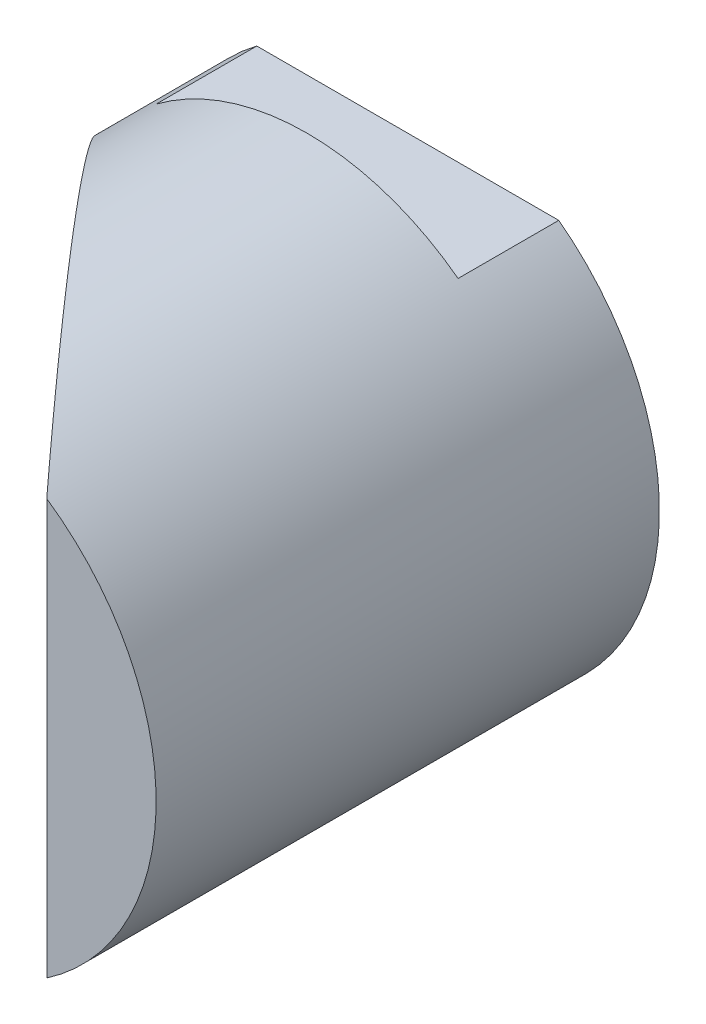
ISO-10303-21;
HEADER;
FILE_DESCRIPTION(('STEP AP214'),'2;1');
FILE_NAME('part.step','',(''),(''),'','','');
FILE_SCHEMA(('AUTOMOTIVE_DESIGN { 1 0 10303 214 1 1 1 1 }'));
ENDSEC;
DATA;
#1=APPLICATION_CONTEXT('core data for automotive mechanical design processes');
#2=APPLICATION_PROTOCOL_DEFINITION('international standard','automotive_design',2000,#1);
#3=PRODUCT_CONTEXT('',#1,'mechanical');
#4=PRODUCT('Part','Part','',(#3));
#5=PRODUCT_RELATED_PRODUCT_CATEGORY('part','',(#4));
#6=PRODUCT_DEFINITION_FORMATION('','',#4);
#7=PRODUCT_DEFINITION_CONTEXT('part definition',#1,'design');
#8=PRODUCT_DEFINITION('design','',#6,#7);
#9=PRODUCT_DEFINITION_SHAPE('','',#8);
#10=(LENGTH_UNIT() NAMED_UNIT(*) SI_UNIT(.MILLI.,.METRE.));
#11=(NAMED_UNIT(*) PLANE_ANGLE_UNIT() SI_UNIT($,.RADIAN.));
#12=(NAMED_UNIT(*) SI_UNIT($,.STERADIAN.) SOLID_ANGLE_UNIT());
#13=UNCERTAINTY_MEASURE_WITH_UNIT(LENGTH_MEASURE(1.E-05),#10,'distance_accuracy_value','');
#14=(GEOMETRIC_REPRESENTATION_CONTEXT(3) GLOBAL_UNCERTAINTY_ASSIGNED_CONTEXT((#13)) GLOBAL_UNIT_ASSIGNED_CONTEXT((#10,
#11,#12)) REPRESENTATION_CONTEXT('',''));
#15=CARTESIAN_POINT('',(0.,0.,0.));
#16=DIRECTION('',(0.,0.,1.));
#17=DIRECTION('',(1.,0.,0.));
#18=AXIS2_PLACEMENT_3D('',#15,#16,#17);
#19=CARTESIAN_POINT('',(0.,0.,0.));
#20=DIRECTION('',(0.,0.,1.));
#21=DIRECTION('',(1.,0.,0.));
#22=AXIS2_PLACEMENT_3D('',#19,#20,#21);
#23=PLANE('',#22);
#24=CARTESIAN_POINT('',(0.,0.,0.));
#25=DIRECTION('',(0.,0.,1.));
#26=DIRECTION('',(1.,0.,0.));
#27=AXIS2_PLACEMENT_3D('',#24,#25,#26);
#28=CIRCLE('',#27,4.3688);
#29=CARTESIAN_POINT('',(4.3688,0.,0.));
#30=VERTEX_POINT('',#29);
#31=EDGE_CURVE('E86',#30,#30,#28,.T.);
#32=ORIENTED_EDGE('',*,*,#31,.T.);
#33=EDGE_LOOP('',(#32));
#34=FACE_BOUND('',#33,.T.);
#35=DIRECTION('',(-1.,0.,0.));
#36=VECTOR('',#35,1.);
#37=CARTESIAN_POINT('',(20.3269466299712,-12.7,0.));
#38=LINE('',#37,#36);
#39=CARTESIAN_POINT('',(9.525,-12.7,0.));
#40=VERTEX_POINT('',#39);
#41=CARTESIAN_POINT('',(-9.525,-12.7,0.));
#42=VERTEX_POINT('',#41);
#43=EDGE_CURVE('E83',#40,#42,#38,.T.);
#44=ORIENTED_EDGE('',*,*,#43,.T.);
#45=CARTESIAN_POINT('',(0.,0.,0.));
#46=DIRECTION('',(0.,0.,1.));
#47=DIRECTION('',(1.,0.,0.));
#48=AXIS2_PLACEMENT_3D('',#45,#46,#47);
#49=CIRCLE('',#48,15.875);
#50=CARTESIAN_POINT('',(-9.525,12.7,0.));
#51=VERTEX_POINT('',#50);
#52=EDGE_CURVE('E99',#51,#42,#49,.T.);
#53=ORIENTED_EDGE('',*,*,#52,.F.);
#54=DIRECTION('',(1.,0.,0.));
#55=VECTOR('',#54,1.);
#56=CARTESIAN_POINT('',(20.3269466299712,12.7,0.));
#57=LINE('',#56,#55);
#58=CARTESIAN_POINT('',(9.525,12.7,0.));
#59=VERTEX_POINT('',#58);
#60=EDGE_CURVE('E96',#51,#59,#57,.T.);
#61=ORIENTED_EDGE('',*,*,#60,.T.);
#62=EDGE_CURVE('E90',#40,#59,#49,.T.);
#63=ORIENTED_EDGE('',*,*,#62,.F.);
#64=EDGE_LOOP('',(#44,#53,#61,#63));
#65=FACE_BOUND('',#64,.T.);
#66=ADVANCED_FACE('F33',(#34,#65),#23,.F.);
#67=CARTESIAN_POINT('',(0.,0.,39.6875));
#68=DIRECTION('',(0.,0.,-1.));
#69=DIRECTION('',(-1.,0.,0.));
#70=AXIS2_PLACEMENT_3D('',#67,#68,#69);
#71=CYLINDRICAL_SURFACE('',#70,15.875);
#72=CARTESIAN_POINT('',(0.,0.,21.4254015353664));
#73=DIRECTION('',(0.754709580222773,0.,-0.656059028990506));
#74=DIRECTION('',(-0.656059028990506,0.,-0.754709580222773));
#75=AXIS2_PLACEMENT_3D('',#72,#73,#74);
#76=ELLIPSE('',#75,24.1975177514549,15.875);
#77=CARTESIAN_POINT('',(8.97503651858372,-13.0944394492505,31.75));
#78=VERTEX_POINT('',#77);
#79=CARTESIAN_POINT('',(8.97503651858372,13.0944394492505,31.75));
#80=VERTEX_POINT('',#79);
#81=EDGE_CURVE('E82',#78,#80,#76,.T.);
#82=ORIENTED_EDGE('',*,*,#81,.T.);
#83=CARTESIAN_POINT('',(0.,0.,31.75));
#84=DIRECTION('',(0.,0.,-1.));
#85=DIRECTION('',(-1.,0.,0.));
#86=AXIS2_PLACEMENT_3D('',#83,#84,#85);
#87=CIRCLE('',#86,15.875);
#88=EDGE_CURVE('E47',#80,#78,#87,.T.);
#89=ORIENTED_EDGE('',*,*,#88,.T.);
#90=EDGE_LOOP('',(#82,#89));
#91=FACE_BOUND('',#90,.T.);
#92=DIRECTION('',(0.,0.,-1.));
#93=VECTOR('',#92,1.);
#94=CARTESIAN_POINT('',(-9.525,-12.7,39.6875));
#95=LINE('',#94,#93);
#96=CARTESIAN_POINT('',(-9.525,-12.7,6.35));
#97=VERTEX_POINT('',#96);
#98=EDGE_CURVE('E41',#97,#42,#95,.T.);
#99=ORIENTED_EDGE('',*,*,#98,.F.);
#100=CARTESIAN_POINT('',(0.,0.,6.35));
#101=DIRECTION('',(0.,0.,-1.));
#102=DIRECTION('',(-1.,0.,0.));
#103=AXIS2_PLACEMENT_3D('',#100,#101,#102);
#104=CIRCLE('',#103,15.875);
#105=CARTESIAN_POINT('',(9.525,-12.7,6.35));
#106=VERTEX_POINT('',#105);
#107=EDGE_CURVE('E110',#106,#97,#104,.T.);
#108=ORIENTED_EDGE('',*,*,#107,.F.);
#109=DIRECTION('',(0.,0.,-1.));
#110=VECTOR('',#109,1.);
#111=CARTESIAN_POINT('',(9.525,-12.7,39.6875));
#112=LINE('',#111,#110);
#113=EDGE_CURVE('E112',#40,#106,#112,.F.);
#114=ORIENTED_EDGE('',*,*,#113,.F.);
#115=ORIENTED_EDGE('',*,*,#62,.T.);
#116=DIRECTION('',(0.,0.,-1.));
#117=VECTOR('',#116,1.);
#118=CARTESIAN_POINT('',(9.525,12.7,39.6875));
#119=LINE('',#118,#117);
#120=CARTESIAN_POINT('',(9.525,12.7,6.35));
#121=VERTEX_POINT('',#120);
#122=EDGE_CURVE('E107',#121,#59,#119,.T.);
#123=ORIENTED_EDGE('',*,*,#122,.F.);
#124=CARTESIAN_POINT('',(0.,0.,6.35));
#125=DIRECTION('',(0.,0.,-1.));
#126=DIRECTION('',(-1.,0.,0.));
#127=AXIS2_PLACEMENT_3D('',#124,#125,#126);
#128=CIRCLE('',#127,15.875);
#129=CARTESIAN_POINT('',(-9.525,12.7,6.35));
#130=VERTEX_POINT('',#129);
#131=EDGE_CURVE('E101',#130,#121,#128,.T.);
#132=ORIENTED_EDGE('',*,*,#131,.F.);
#133=DIRECTION('',(0.,0.,-1.));
#134=VECTOR('',#133,1.);
#135=CARTESIAN_POINT('',(-9.52500000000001,12.7,39.6875));
#136=LINE('',#135,#134);
#137=EDGE_CURVE('E104',#51,#130,#136,.F.);
#138=ORIENTED_EDGE('',*,*,#137,.F.);
#139=ORIENTED_EDGE('',*,*,#52,.T.);
#140=EDGE_LOOP('',(#99,#108,#114,#115,#123,#132,#138,#139));
#141=FACE_BOUND('',#140,.T.);
#142=ADVANCED_FACE('F35',(#91,#141),#71,.T.);
#143=CARTESIAN_POINT('',(0.,0.,39.6875));
#144=DIRECTION('',(0.,0.,-1.));
#145=DIRECTION('',(-1.,0.,0.));
#146=AXIS2_PLACEMENT_3D('',#143,#144,#145);
#147=CYLINDRICAL_SURFACE('',#146,4.3688);
#148=CARTESIAN_POINT('',(0.,0.,21.4254015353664));
#149=DIRECTION('',(0.754709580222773,0.,-0.656059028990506));
#150=DIRECTION('',(-0.656059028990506,0.,-0.754709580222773));
#151=AXIS2_PLACEMENT_3D('',#148,#149,#150);
#152=ELLIPSE('',#151,6.65915688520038,4.3688);
#153=CARTESIAN_POINT('',(-4.3688,0.,16.3996720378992));
#154=VERTEX_POINT('',#153);
#155=EDGE_CURVE('E87',#154,#154,#152,.T.);
#156=ORIENTED_EDGE('',*,*,#155,.F.);
#157=EDGE_LOOP('',(#156));
#158=FACE_BOUND('',#157,.T.);
#159=ORIENTED_EDGE('',*,*,#31,.F.);
#160=EDGE_LOOP('',(#159));
#161=FACE_BOUND('',#160,.T.);
#162=ADVANCED_FACE('F146',(#158,#161),#147,.F.);
#163=CARTESIAN_POINT('',(15.875,-15.875,39.6875));
#164=DIRECTION('',(0.754709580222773,0.,-0.656059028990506));
#165=DIRECTION('',(-0.656059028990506,0.,-0.754709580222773));
#166=AXIS2_PLACEMENT_3D('',#163,#164,#165);
#167=PLANE('',#166);
#168=ORIENTED_EDGE('',*,*,#155,.T.);
#169=EDGE_LOOP('',(#168));
#170=FACE_BOUND('',#169,.T.);
#171=ORIENTED_EDGE('',*,*,#81,.F.);
#172=DIRECTION('',(0.,1.,0.));
#173=VECTOR('',#172,1.);
#174=CARTESIAN_POINT('',(8.97503651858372,-15.875,31.75));
#175=LINE('',#174,#173);
#176=EDGE_CURVE('E11',#78,#80,#175,.T.);
#177=ORIENTED_EDGE('',*,*,#176,.T.);
#178=EDGE_LOOP('',(#171,#177));
#179=FACE_BOUND('',#178,.T.);
#180=ADVANCED_FACE('F85',(#170,#179),#167,.F.);
#181=CARTESIAN_POINT('',(20.3269466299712,12.7,6.35));
#182=DIRECTION('',(0.,1.,0.));
#183=DIRECTION('',(-1.,0.,0.));
#184=AXIS2_PLACEMENT_3D('',#181,#182,#183);
#185=PLANE('',#184);
#186=ORIENTED_EDGE('',*,*,#122,.T.);
#187=ORIENTED_EDGE('',*,*,#60,.F.);
#188=ORIENTED_EDGE('',*,*,#137,.T.);
#189=DIRECTION('',(1.,0.,0.));
#190=VECTOR('',#189,1.);
#191=CARTESIAN_POINT('',(20.3269466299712,12.7,6.35));
#192=LINE('',#191,#190);
#193=EDGE_CURVE('E93',#130,#121,#192,.T.);
#194=ORIENTED_EDGE('',*,*,#193,.T.);
#195=EDGE_LOOP('',(#186,#187,#188,#194));
#196=FACE_BOUND('',#195,.T.);
#197=ADVANCED_FACE('F129',(#196),#185,.T.);
#198=CARTESIAN_POINT('',(0.,0.,6.35));
#199=DIRECTION('',(0.,0.,-1.));
#200=DIRECTION('',(-1.,0.,0.));
#201=AXIS2_PLACEMENT_3D('',#198,#199,#200);
#202=PLANE('',#201);
#203=ORIENTED_EDGE('',*,*,#131,.T.);
#204=ORIENTED_EDGE('',*,*,#193,.F.);
#205=EDGE_LOOP('',(#203,#204));
#206=FACE_BOUND('',#205,.T.);
#207=ADVANCED_FACE('F139',(#206),#202,.T.);
#208=CARTESIAN_POINT('',(20.3269466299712,-12.7,6.35));
#209=DIRECTION('',(0.,-1.,0.));
#210=DIRECTION('',(0.,0.,-1.));
#211=AXIS2_PLACEMENT_3D('',#208,#209,#210);
#212=PLANE('',#211);
#213=ORIENTED_EDGE('',*,*,#98,.T.);
#214=ORIENTED_EDGE('',*,*,#43,.F.);
#215=ORIENTED_EDGE('',*,*,#113,.T.);
#216=DIRECTION('',(-1.,0.,0.));
#217=VECTOR('',#216,1.);
#218=CARTESIAN_POINT('',(20.3269466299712,-12.7,6.35));
#219=LINE('',#218,#217);
#220=EDGE_CURVE('E53',#106,#97,#219,.T.);
#221=ORIENTED_EDGE('',*,*,#220,.T.);
#222=EDGE_LOOP('',(#213,#214,#215,#221));
#223=FACE_BOUND('',#222,.T.);
#224=ADVANCED_FACE('F116',(#223),#212,.T.);
#225=CARTESIAN_POINT('',(0.,0.,6.35));
#226=DIRECTION('',(0.,0.,-1.));
#227=DIRECTION('',(-1.,0.,0.));
#228=AXIS2_PLACEMENT_3D('',#225,#226,#227);
#229=PLANE('',#228);
#230=ORIENTED_EDGE('',*,*,#107,.T.);
#231=ORIENTED_EDGE('',*,*,#220,.F.);
#232=EDGE_LOOP('',(#230,#231));
#233=FACE_BOUND('',#232,.T.);
#234=ADVANCED_FACE('F131',(#233),#229,.T.);
#235=CARTESIAN_POINT('',(28.8322999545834,-15.875,31.75));
#236=DIRECTION('',(0.,0.,-1.));
#237=DIRECTION('',(-1.,0.,0.));
#238=AXIS2_PLACEMENT_3D('',#235,#236,#237);
#239=PLANE('',#238);
#240=ORIENTED_EDGE('',*,*,#176,.F.);
#241=ORIENTED_EDGE('',*,*,#88,.F.);
#242=EDGE_LOOP('',(#240,#241));
#243=FACE_BOUND('',#242,.T.);
#244=ADVANCED_FACE('F76',(#243),#239,.F.);
#245=CLOSED_SHELL('',(#66,#142,#162,#180,#197,#207,#224,#234,#244));
#246=MANIFOLD_SOLID_BREP('B2',#245);
#247=ADVANCED_BREP_SHAPE_REPRESENTATION('',(#18,#246),#14);
#248=SHAPE_DEFINITION_REPRESENTATION(#9,#247);
ENDSEC;
END-ISO-10303-21;
